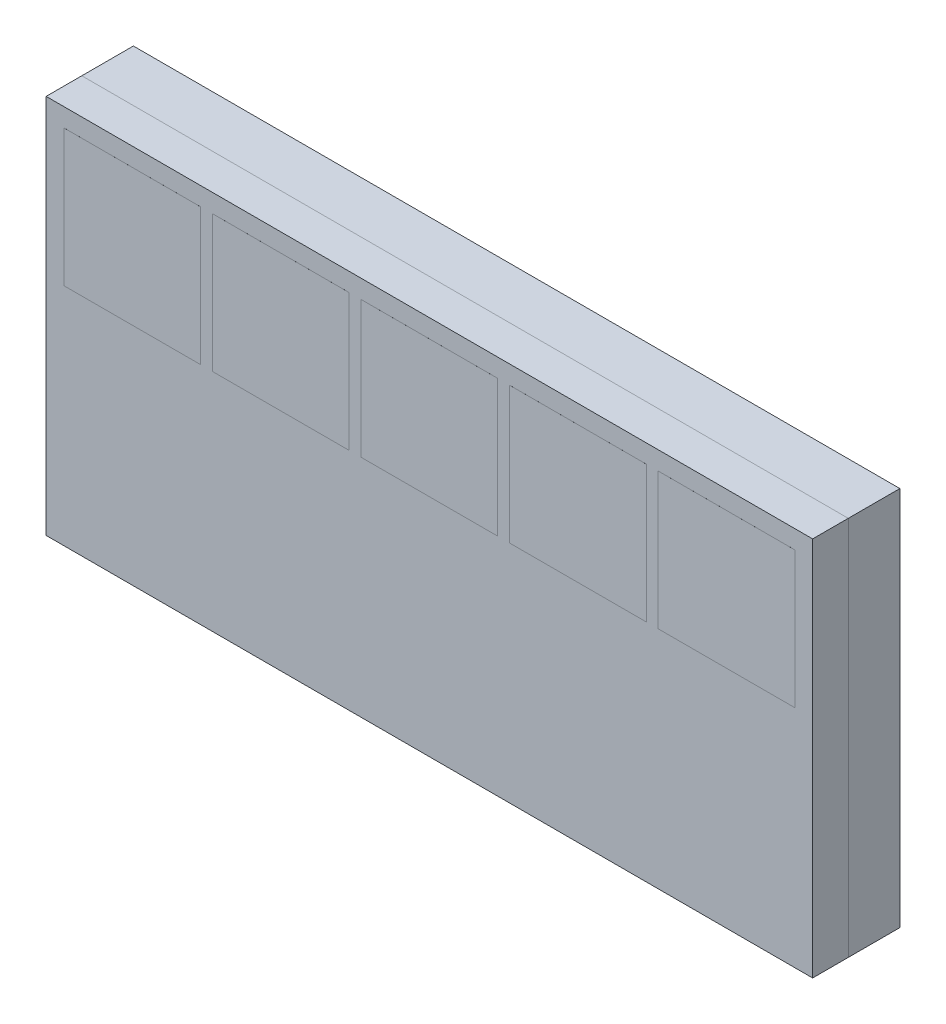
from build123d import *

# Parameters (mm, degrees)
SKETCH_1_W      = 6.45
SKETCH_1_H      = 3.2
EXTRUDE_1_DEPTH = 0.3
SKETCH_2_W      = 1.15
SKETCH_2_H      = 1.15
EXTRUDE_2_DEPTH = 0.0001
SKETCH_4_W      = 6.45
SKETCH_4_H      = 3.2
EXTRUDE_3_DEPTH = 0.434
EXTRUDE_4_DEPTH = 0.056


with BuildPart() as part:
    # Sketch 1 → Extrude 1 (new body)
    with BuildSketch(Plane.XY):
        with Locations((0, -0.87)):
            Rectangle(SKETCH_1_W, SKETCH_1_H)
    extrude(amount=-EXTRUDE_1_DEPTH)

    # Sketch 2 → Extrude 2 (add)
    with BuildSketch(Plane.XY):
        with Locations((-2.5, 0)):
            Rectangle(SKETCH_2_W, SKETCH_2_H)
        with Locations((-1.25, 0)):
            Rectangle(SKETCH_2_W, SKETCH_2_H)
        Rectangle(SKETCH_2_W, SKETCH_2_H)
        with Locations((1.25, 0)):
            Rectangle(SKETCH_2_W, SKETCH_2_H)
        with Locations((2.5, 0)):
            Rectangle(SKETCH_2_W, SKETCH_2_H)
    extrude(amount=EXTRUDE_2_DEPTH)


with BuildPart() as body_2:
    # Sketch 4 → Extrude 3 (new body)
    with BuildSketch(Plane(origin=(0, 0, -0.3), x_dir=(-1, 0, 0), z_dir=(0, 0, -1))):
        with Locations((0, -0.87)):
            Rectangle(SKETCH_4_W, SKETCH_4_H)
    extrude(amount=EXTRUDE_3_DEPTH)

    # Sketch 5 → Extrude 4 (add)
    with BuildSketch(Plane(origin=(0, 0, -0.734), x_dir=(-1, 0, 0), z_dir=(0, 0, -1))):
        with BuildLine():
            Line((-2.45, 0.55), (-0.5, 0.55))
            ThreePointArc((-0.5, 0.55), (-0.287867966, 0.462132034), (-0.2, 0.25))
            Line((-0.2, 0.25), (-0.2, -0.37))
            ThreePointArc((-0.2, -0.37), (-0.287867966, -0.582132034), (-0.5, -0.67))
            Line((-0.5, -0.67), (-2.45, -0.67))
            ThreePointArc((-2.45, -0.67), (-2.662132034, -0.582132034), (-2.75, -0.37))
            Line((-2.75, -0.37), (-2.75, 0.25))
            ThreePointArc((-2.75, 0.25), (-2.662132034, 0.462132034), (-2.45, 0.55))
        make_face()
        with BuildLine():
            Line((0.2, 0.25), (0.2, -0.37))
            ThreePointArc((0.2, -0.37), (0.287867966, -0.582132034), (0.5, -0.67))
            Line((0.5, -0.67), (2.45, -0.67))
            ThreePointArc((2.45, -0.67), (2.662132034, -0.582132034), (2.75, -0.37))
            Line((2.75, -0.37), (2.75, 0.25))
            ThreePointArc((2.75, 0.25), (2.662132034, 0.462132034), (2.45, 0.55))
            Line((2.45, 0.55), (0.5, 0.55))
            ThreePointArc((0.5, 0.55), (0.287867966, 0.462132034), (0.2, 0.25))
        make_face()
        with BuildLine():
            Line((0.2, -1.47), (0.2, -1.99))
            ThreePointArc((0.2, -1.99), (0.287867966, -2.202132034), (0.5, -2.29))
            Line((0.5, -2.29), (2.45, -2.29))
            ThreePointArc((2.45, -2.29), (2.662132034, -2.202132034), (2.75, -1.99))
            Line((2.75, -1.99), (2.75, -1.37))
            ThreePointArc((2.75, -1.37), (2.662132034, -1.157867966), (2.45, -1.07))
            Line((2.45, -1.07), (0.6, -1.07))
            Line((0.6, -1.07), (0.2, -1.47))
        make_face()
        with BuildLine():
            Line((-2.75, -1.37), (-2.75, -1.99))
            ThreePointArc((-2.75, -1.99), (-2.662132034, -2.202132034), (-2.45, -2.29))
            Line((-2.45, -2.29), (-0.5, -2.29))
            ThreePointArc((-0.5, -2.29), (-0.287867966, -2.202132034), (-0.2, -1.99))
            Line((-0.2, -1.99), (-0.2, -1.37))
            ThreePointArc((-0.2, -1.37), (-0.287867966, -1.157867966), (-0.5, -1.07))
            Line((-0.5, -1.07), (-2.45, -1.07))
            ThreePointArc((-2.45, -1.07), (-2.662132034, -1.157867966), (-2.75, -1.37))
        make_face()
    extrude(amount=EXTRUDE_4_DEPTH)


solid = Compound([part.part, body_2.part])
